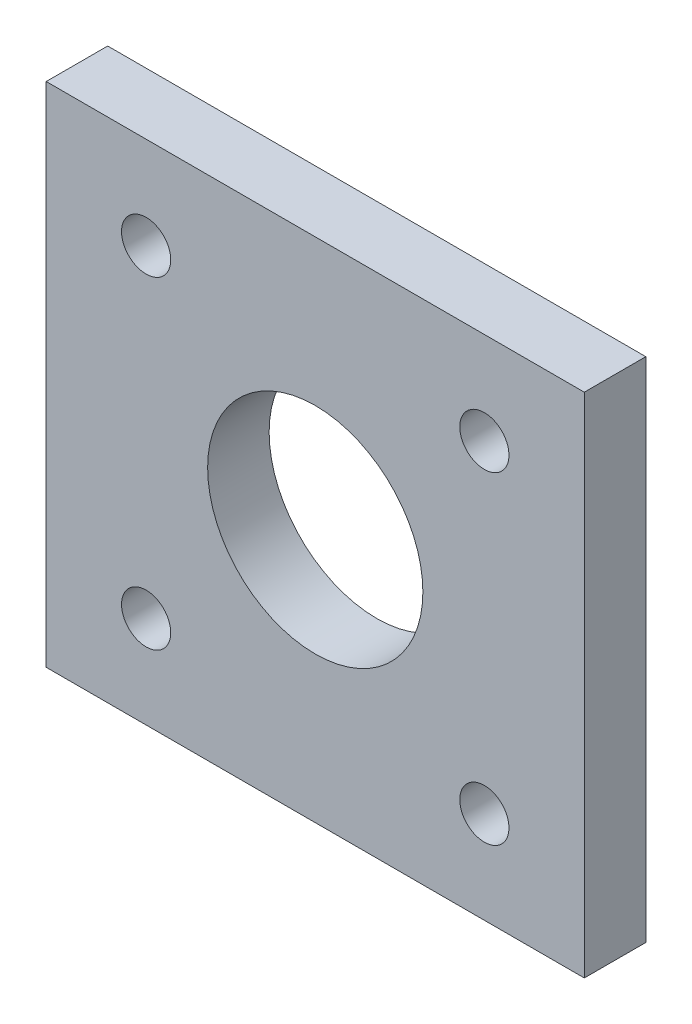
ISO-10303-21;
HEADER;
FILE_DESCRIPTION(('STEP AP214'),'2;1');
FILE_NAME('part.step','',(''),(''),'','','');
FILE_SCHEMA(('AUTOMOTIVE_DESIGN { 1 0 10303 214 1 1 1 1 }'));
ENDSEC;
DATA;
#1=APPLICATION_CONTEXT('core data for automotive mechanical design processes');
#2=APPLICATION_PROTOCOL_DEFINITION('international standard','automotive_design',2000,#1);
#3=PRODUCT_CONTEXT('',#1,'mechanical');
#4=PRODUCT('Part','Part','',(#3));
#5=PRODUCT_RELATED_PRODUCT_CATEGORY('part','',(#4));
#6=PRODUCT_DEFINITION_FORMATION('','',#4);
#7=PRODUCT_DEFINITION_CONTEXT('part definition',#1,'design');
#8=PRODUCT_DEFINITION('design','',#6,#7);
#9=PRODUCT_DEFINITION_SHAPE('','',#8);
#10=(LENGTH_UNIT() NAMED_UNIT(*) SI_UNIT(.MILLI.,.METRE.));
#11=(NAMED_UNIT(*) PLANE_ANGLE_UNIT() SI_UNIT($,.RADIAN.));
#12=(NAMED_UNIT(*) SI_UNIT($,.STERADIAN.) SOLID_ANGLE_UNIT());
#13=UNCERTAINTY_MEASURE_WITH_UNIT(LENGTH_MEASURE(1.E-05),#10,'distance_accuracy_value','');
#14=(GEOMETRIC_REPRESENTATION_CONTEXT(3) GLOBAL_UNCERTAINTY_ASSIGNED_CONTEXT((#13)) GLOBAL_UNIT_ASSIGNED_CONTEXT((#10,
#11,#12)) REPRESENTATION_CONTEXT('',''));
#15=CARTESIAN_POINT('',(0.,0.,0.));
#16=DIRECTION('',(0.,0.,1.));
#17=DIRECTION('',(1.,0.,0.));
#18=AXIS2_PLACEMENT_3D('',#15,#16,#17);
#19=CARTESIAN_POINT('',(0.,0.,4.));
#20=DIRECTION('',(0.,0.,1.));
#21=DIRECTION('',(1.,0.,0.));
#22=AXIS2_PLACEMENT_3D('',#19,#20,#21);
#23=PLANE('',#22);
#24=CARTESIAN_POINT('',(-8.9244680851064,-22.4595744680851,4.));
#25=DIRECTION('',(0.,0.,-1.));
#26=DIRECTION('',(-1.,0.,0.));
#27=AXIS2_PLACEMENT_3D('',#24,#25,#26);
#28=CIRCLE('',#27,1.6);
#29=CARTESIAN_POINT('',(-10.5244680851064,-22.4595744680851,4.));
#30=VERTEX_POINT('',#29);
#31=EDGE_CURVE('E117',#30,#30,#28,.F.);
#32=ORIENTED_EDGE('',*,*,#31,.F.);
#33=EDGE_LOOP('',(#32));
#34=FACE_BOUND('',#33,.T.);
#35=CARTESIAN_POINT('',(2.07553191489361,-11.9595744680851,4.));
#36=DIRECTION('',(0.,0.,-1.));
#37=DIRECTION('',(-1.,0.,0.));
#38=AXIS2_PLACEMENT_3D('',#35,#36,#37);
#39=CIRCLE('',#38,7.);
#40=CARTESIAN_POINT('',(-4.92446808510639,-11.9595744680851,4.));
#41=VERTEX_POINT('',#40);
#42=EDGE_CURVE('E128',#41,#41,#39,.T.);
#43=ORIENTED_EDGE('',*,*,#42,.T.);
#44=EDGE_LOOP('',(#43));
#45=FACE_BOUND('',#44,.T.);
#46=CARTESIAN_POINT('',(13.0755319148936,-1.45957446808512,4.));
#47=DIRECTION('',(0.,0.,-1.));
#48=DIRECTION('',(-1.,0.,0.));
#49=AXIS2_PLACEMENT_3D('',#46,#47,#48);
#50=CIRCLE('',#49,1.6);
#51=CARTESIAN_POINT('',(11.4755319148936,-1.45957446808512,4.));
#52=VERTEX_POINT('',#51);
#53=EDGE_CURVE('E104',#52,#52,#50,.T.);
#54=ORIENTED_EDGE('',*,*,#53,.T.);
#55=EDGE_LOOP('',(#54));
#56=FACE_BOUND('',#55,.T.);
#57=CARTESIAN_POINT('',(-8.92446808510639,-1.45957446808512,4.));
#58=DIRECTION('',(0.,0.,-1.));
#59=DIRECTION('',(-1.,0.,0.));
#60=AXIS2_PLACEMENT_3D('',#57,#58,#59);
#61=CIRCLE('',#60,1.6);
#62=CARTESIAN_POINT('',(-10.5244680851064,-1.45957446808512,4.));
#63=VERTEX_POINT('',#62);
#64=EDGE_CURVE('E111',#63,#63,#61,.F.);
#65=ORIENTED_EDGE('',*,*,#64,.F.);
#66=EDGE_LOOP('',(#65));
#67=FACE_BOUND('',#66,.T.);
#68=CARTESIAN_POINT('',(13.0755319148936,-22.4595744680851,4.));
#69=DIRECTION('',(0.,0.,-1.));
#70=DIRECTION('',(-1.,0.,0.));
#71=AXIS2_PLACEMENT_3D('',#68,#69,#70);
#72=CIRCLE('',#71,1.6);
#73=CARTESIAN_POINT('',(11.4755319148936,-22.4595744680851,4.));
#74=VERTEX_POINT('',#73);
#75=EDGE_CURVE('E123',#74,#74,#72,.T.);
#76=ORIENTED_EDGE('',*,*,#75,.T.);
#77=EDGE_LOOP('',(#76));
#78=FACE_BOUND('',#77,.T.);
#79=DIRECTION('',(0.,1.,0.));
#80=VECTOR('',#79,1.);
#81=CARTESIAN_POINT('',(19.5755319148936,0.,4.));
#82=LINE('',#81,#80);
#83=CARTESIAN_POINT('',(19.5755319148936,-28.4595744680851,4.));
#84=VERTEX_POINT('',#83);
#85=CARTESIAN_POINT('',(19.5755319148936,4.5404255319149,4.));
#86=VERTEX_POINT('',#85);
#87=EDGE_CURVE('E89',#84,#86,#82,.T.);
#88=ORIENTED_EDGE('',*,*,#87,.T.);
#89=DIRECTION('',(-1.,0.,0.));
#90=VECTOR('',#89,1.);
#91=CARTESIAN_POINT('',(0.,4.54042553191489,4.));
#92=LINE('',#91,#90);
#93=CARTESIAN_POINT('',(-15.4244680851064,4.54042553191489,4.));
#94=VERTEX_POINT('',#93);
#95=EDGE_CURVE('E52',#86,#94,#92,.T.);
#96=ORIENTED_EDGE('',*,*,#95,.T.);
#97=DIRECTION('',(0.,-1.,0.));
#98=VECTOR('',#97,1.);
#99=CARTESIAN_POINT('',(-15.4244680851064,0.,4.));
#100=LINE('',#99,#98);
#101=CARTESIAN_POINT('',(-15.4244680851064,-28.4595744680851,4.));
#102=VERTEX_POINT('',#101);
#103=EDGE_CURVE('E94',#94,#102,#100,.T.);
#104=ORIENTED_EDGE('',*,*,#103,.T.);
#105=DIRECTION('',(1.,0.,0.));
#106=VECTOR('',#105,1.);
#107=CARTESIAN_POINT('',(0.,-28.4595744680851,4.));
#108=LINE('',#107,#106);
#109=EDGE_CURVE('E80',#102,#84,#108,.T.);
#110=ORIENTED_EDGE('',*,*,#109,.T.);
#111=EDGE_LOOP('',(#88,#96,#104,#110));
#112=FACE_BOUND('',#111,.T.);
#113=ADVANCED_FACE('F37',(#34,#45,#56,#67,#78,#112),#23,.T.);
#114=CARTESIAN_POINT('',(0.,0.,0.));
#115=DIRECTION('',(0.,0.,1.));
#116=DIRECTION('',(1.,0.,0.));
#117=AXIS2_PLACEMENT_3D('',#114,#115,#116);
#118=PLANE('',#117);
#119=CARTESIAN_POINT('',(-8.9244680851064,-22.4595744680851,0.));
#120=DIRECTION('',(0.,0.,-1.));
#121=DIRECTION('',(-1.,0.,0.));
#122=AXIS2_PLACEMENT_3D('',#119,#120,#121);
#123=CIRCLE('',#122,1.6);
#124=CARTESIAN_POINT('',(-10.5244680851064,-22.4595744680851,0.));
#125=VERTEX_POINT('',#124);
#126=EDGE_CURVE('E120',#125,#125,#123,.F.);
#127=ORIENTED_EDGE('',*,*,#126,.T.);
#128=EDGE_LOOP('',(#127));
#129=FACE_BOUND('',#128,.T.);
#130=CARTESIAN_POINT('',(-8.92446808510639,-1.45957446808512,0.));
#131=DIRECTION('',(0.,0.,-1.));
#132=DIRECTION('',(-1.,0.,0.));
#133=AXIS2_PLACEMENT_3D('',#130,#131,#132);
#134=CIRCLE('',#133,1.6);
#135=CARTESIAN_POINT('',(-10.5244680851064,-1.45957446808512,0.));
#136=VERTEX_POINT('',#135);
#137=EDGE_CURVE('E114',#136,#136,#134,.F.);
#138=ORIENTED_EDGE('',*,*,#137,.T.);
#139=EDGE_LOOP('',(#138));
#140=FACE_BOUND('',#139,.T.);
#141=CARTESIAN_POINT('',(2.07553191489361,-11.9595744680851,0.));
#142=DIRECTION('',(0.,0.,-1.));
#143=DIRECTION('',(-1.,0.,0.));
#144=AXIS2_PLACEMENT_3D('',#141,#142,#143);
#145=CIRCLE('',#144,7.);
#146=CARTESIAN_POINT('',(-4.92446808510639,-11.9595744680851,0.));
#147=VERTEX_POINT('',#146);
#148=EDGE_CURVE('E107',#147,#147,#145,.T.);
#149=ORIENTED_EDGE('',*,*,#148,.F.);
#150=EDGE_LOOP('',(#149));
#151=FACE_BOUND('',#150,.T.);
#152=CARTESIAN_POINT('',(13.0755319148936,-1.45957446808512,0.));
#153=DIRECTION('',(0.,0.,-1.));
#154=DIRECTION('',(-1.,0.,0.));
#155=AXIS2_PLACEMENT_3D('',#152,#153,#154);
#156=CIRCLE('',#155,1.6);
#157=CARTESIAN_POINT('',(11.4755319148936,-1.45957446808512,0.));
#158=VERTEX_POINT('',#157);
#159=EDGE_CURVE('E108',#158,#158,#156,.T.);
#160=ORIENTED_EDGE('',*,*,#159,.F.);
#161=EDGE_LOOP('',(#160));
#162=FACE_BOUND('',#161,.T.);
#163=CARTESIAN_POINT('',(13.0755319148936,-22.4595744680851,0.));
#164=DIRECTION('',(0.,0.,-1.));
#165=DIRECTION('',(-1.,0.,0.));
#166=AXIS2_PLACEMENT_3D('',#163,#164,#165);
#167=CIRCLE('',#166,1.6);
#168=CARTESIAN_POINT('',(11.4755319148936,-22.4595744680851,0.));
#169=VERTEX_POINT('',#168);
#170=EDGE_CURVE('E101',#169,#169,#167,.T.);
#171=ORIENTED_EDGE('',*,*,#170,.F.);
#172=EDGE_LOOP('',(#171));
#173=FACE_BOUND('',#172,.T.);
#174=DIRECTION('',(-1.,0.,0.));
#175=VECTOR('',#174,1.);
#176=CARTESIAN_POINT('',(0.,4.54042553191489,0.));
#177=LINE('',#176,#175);
#178=CARTESIAN_POINT('',(19.5755319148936,4.5404255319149,0.));
#179=VERTEX_POINT('',#178);
#180=CARTESIAN_POINT('',(-15.4244680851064,4.54042553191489,0.));
#181=VERTEX_POINT('',#180);
#182=EDGE_CURVE('E11',#179,#181,#177,.T.);
#183=ORIENTED_EDGE('',*,*,#182,.F.);
#184=DIRECTION('',(0.,1.,0.));
#185=VECTOR('',#184,1.);
#186=CARTESIAN_POINT('',(19.5755319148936,0.,0.));
#187=LINE('',#186,#185);
#188=CARTESIAN_POINT('',(19.5755319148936,-28.4595744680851,0.));
#189=VERTEX_POINT('',#188);
#190=EDGE_CURVE('E131',#189,#179,#187,.T.);
#191=ORIENTED_EDGE('',*,*,#190,.F.);
#192=DIRECTION('',(1.,0.,0.));
#193=VECTOR('',#192,1.);
#194=CARTESIAN_POINT('',(0.,-28.4595744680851,0.));
#195=LINE('',#194,#193);
#196=CARTESIAN_POINT('',(-15.4244680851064,-28.4595744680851,0.));
#197=VERTEX_POINT('',#196);
#198=EDGE_CURVE('E83',#197,#189,#195,.T.);
#199=ORIENTED_EDGE('',*,*,#198,.F.);
#200=DIRECTION('',(0.,-1.,0.));
#201=VECTOR('',#200,1.);
#202=CARTESIAN_POINT('',(-15.4244680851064,0.,0.));
#203=LINE('',#202,#201);
#204=EDGE_CURVE('E45',#181,#197,#203,.T.);
#205=ORIENTED_EDGE('',*,*,#204,.F.);
#206=EDGE_LOOP('',(#183,#191,#199,#205));
#207=FACE_BOUND('',#206,.T.);
#208=ADVANCED_FACE('F39',(#129,#140,#151,#162,#173,#207),#118,.F.);
#209=CARTESIAN_POINT('',(2.07553191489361,-11.9595744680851,4.));
#210=DIRECTION('',(0.,0.,-1.));
#211=DIRECTION('',(-1.,0.,0.));
#212=AXIS2_PLACEMENT_3D('',#209,#210,#211);
#213=CYLINDRICAL_SURFACE('',#212,7.);
#214=ORIENTED_EDGE('',*,*,#42,.F.);
#215=EDGE_LOOP('',(#214));
#216=FACE_BOUND('',#215,.T.);
#217=ORIENTED_EDGE('',*,*,#148,.T.);
#218=EDGE_LOOP('',(#217));
#219=FACE_BOUND('',#218,.T.);
#220=ADVANCED_FACE('F160',(#216,#219),#213,.F.);
#221=CARTESIAN_POINT('',(13.0755319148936,-1.45957446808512,4.));
#222=DIRECTION('',(0.,0.,-1.));
#223=DIRECTION('',(-1.,0.,0.));
#224=AXIS2_PLACEMENT_3D('',#221,#222,#223);
#225=CYLINDRICAL_SURFACE('',#224,1.6);
#226=ORIENTED_EDGE('',*,*,#53,.F.);
#227=EDGE_LOOP('',(#226));
#228=FACE_BOUND('',#227,.T.);
#229=ORIENTED_EDGE('',*,*,#159,.T.);
#230=EDGE_LOOP('',(#229));
#231=FACE_BOUND('',#230,.T.);
#232=ADVANCED_FACE('F166',(#228,#231),#225,.F.);
#233=CARTESIAN_POINT('',(-8.92446808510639,-1.45957446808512,4.));
#234=DIRECTION('',(0.,0.,-1.));
#235=DIRECTION('',(-1.,0.,0.));
#236=AXIS2_PLACEMENT_3D('',#233,#234,#235);
#237=CYLINDRICAL_SURFACE('',#236,1.6);
#238=ORIENTED_EDGE('',*,*,#64,.T.);
#239=EDGE_LOOP('',(#238));
#240=FACE_BOUND('',#239,.T.);
#241=ORIENTED_EDGE('',*,*,#137,.F.);
#242=EDGE_LOOP('',(#241));
#243=FACE_BOUND('',#242,.T.);
#244=ADVANCED_FACE('F171',(#240,#243),#237,.F.);
#245=CARTESIAN_POINT('',(-8.9244680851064,-22.4595744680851,4.));
#246=DIRECTION('',(0.,0.,-1.));
#247=DIRECTION('',(-1.,0.,0.));
#248=AXIS2_PLACEMENT_3D('',#245,#246,#247);
#249=CYLINDRICAL_SURFACE('',#248,1.6);
#250=ORIENTED_EDGE('',*,*,#31,.T.);
#251=EDGE_LOOP('',(#250));
#252=FACE_BOUND('',#251,.T.);
#253=ORIENTED_EDGE('',*,*,#126,.F.);
#254=EDGE_LOOP('',(#253));
#255=FACE_BOUND('',#254,.T.);
#256=ADVANCED_FACE('F150',(#252,#255),#249,.F.);
#257=CARTESIAN_POINT('',(13.0755319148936,-22.4595744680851,4.));
#258=DIRECTION('',(0.,0.,-1.));
#259=DIRECTION('',(-1.,0.,0.));
#260=AXIS2_PLACEMENT_3D('',#257,#258,#259);
#261=CYLINDRICAL_SURFACE('',#260,1.6);
#262=ORIENTED_EDGE('',*,*,#75,.F.);
#263=EDGE_LOOP('',(#262));
#264=FACE_BOUND('',#263,.T.);
#265=ORIENTED_EDGE('',*,*,#170,.T.);
#266=EDGE_LOOP('',(#265));
#267=FACE_BOUND('',#266,.T.);
#268=ADVANCED_FACE('F143',(#264,#267),#261,.F.);
#269=CARTESIAN_POINT('',(0.,4.54042553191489,-6.));
#270=DIRECTION('',(0.,1.,0.));
#271=DIRECTION('',(-1.,0.,0.));
#272=AXIS2_PLACEMENT_3D('',#269,#270,#271);
#273=PLANE('',#272);
#274=ORIENTED_EDGE('',*,*,#182,.T.);
#275=DIRECTION('',(0.,0.,1.));
#276=VECTOR('',#275,1.);
#277=CARTESIAN_POINT('',(-15.4244680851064,4.54042553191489,-6.));
#278=LINE('',#277,#276);
#279=EDGE_CURVE('E99',#181,#94,#278,.T.);
#280=ORIENTED_EDGE('',*,*,#279,.T.);
#281=ORIENTED_EDGE('',*,*,#95,.F.);
#282=DIRECTION('',(0.,0.,1.));
#283=VECTOR('',#282,1.);
#284=CARTESIAN_POINT('',(19.5755319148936,4.5404255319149,-6.));
#285=LINE('',#284,#283);
#286=EDGE_CURVE('E86',#179,#86,#285,.T.);
#287=ORIENTED_EDGE('',*,*,#286,.F.);
#288=EDGE_LOOP('',(#274,#280,#281,#287));
#289=FACE_BOUND('',#288,.T.);
#290=ADVANCED_FACE('F141',(#289),#273,.T.);
#291=CARTESIAN_POINT('',(-15.4244680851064,0.,-6.));
#292=DIRECTION('',(-1.,0.,0.));
#293=DIRECTION('',(0.,-1.,0.));
#294=AXIS2_PLACEMENT_3D('',#291,#292,#293);
#295=PLANE('',#294);
#296=ORIENTED_EDGE('',*,*,#204,.T.);
#297=DIRECTION('',(0.,0.,1.));
#298=VECTOR('',#297,1.);
#299=CARTESIAN_POINT('',(-15.4244680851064,-28.4595744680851,-6.));
#300=LINE('',#299,#298);
#301=EDGE_CURVE('E85',#197,#102,#300,.T.);
#302=ORIENTED_EDGE('',*,*,#301,.T.);
#303=ORIENTED_EDGE('',*,*,#103,.F.);
#304=ORIENTED_EDGE('',*,*,#279,.F.);
#305=EDGE_LOOP('',(#296,#302,#303,#304));
#306=FACE_BOUND('',#305,.T.);
#307=ADVANCED_FACE('F138',(#306),#295,.T.);
#308=CARTESIAN_POINT('',(0.,-28.4595744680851,-6.));
#309=DIRECTION('',(0.,-1.,0.));
#310=DIRECTION('',(1.,0.,0.));
#311=AXIS2_PLACEMENT_3D('',#308,#309,#310);
#312=PLANE('',#311);
#313=ORIENTED_EDGE('',*,*,#198,.T.);
#314=DIRECTION('',(0.,0.,1.));
#315=VECTOR('',#314,1.);
#316=CARTESIAN_POINT('',(19.5755319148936,-28.4595744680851,-6.));
#317=LINE('',#316,#315);
#318=EDGE_CURVE('E60',#189,#84,#317,.T.);
#319=ORIENTED_EDGE('',*,*,#318,.T.);
#320=ORIENTED_EDGE('',*,*,#109,.F.);
#321=ORIENTED_EDGE('',*,*,#301,.F.);
#322=EDGE_LOOP('',(#313,#319,#320,#321));
#323=FACE_BOUND('',#322,.T.);
#324=ADVANCED_FACE('F77',(#323),#312,.T.);
#325=CARTESIAN_POINT('',(19.5755319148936,0.,-6.));
#326=DIRECTION('',(1.,0.,0.));
#327=DIRECTION('',(0.,0.,-1.));
#328=AXIS2_PLACEMENT_3D('',#325,#326,#327);
#329=PLANE('',#328);
#330=ORIENTED_EDGE('',*,*,#190,.T.);
#331=ORIENTED_EDGE('',*,*,#286,.T.);
#332=ORIENTED_EDGE('',*,*,#87,.F.);
#333=ORIENTED_EDGE('',*,*,#318,.F.);
#334=EDGE_LOOP('',(#330,#331,#332,#333));
#335=FACE_BOUND('',#334,.T.);
#336=ADVANCED_FACE('F90',(#335),#329,.T.);
#337=CLOSED_SHELL('',(#113,#208,#220,#232,#244,#256,#268,#290,#307,#324,#336));
#338=MANIFOLD_SOLID_BREP('B2',#337);
#339=ADVANCED_BREP_SHAPE_REPRESENTATION('',(#18,#338),#14);
#340=SHAPE_DEFINITION_REPRESENTATION(#9,#339);
ENDSEC;
END-ISO-10303-21;
